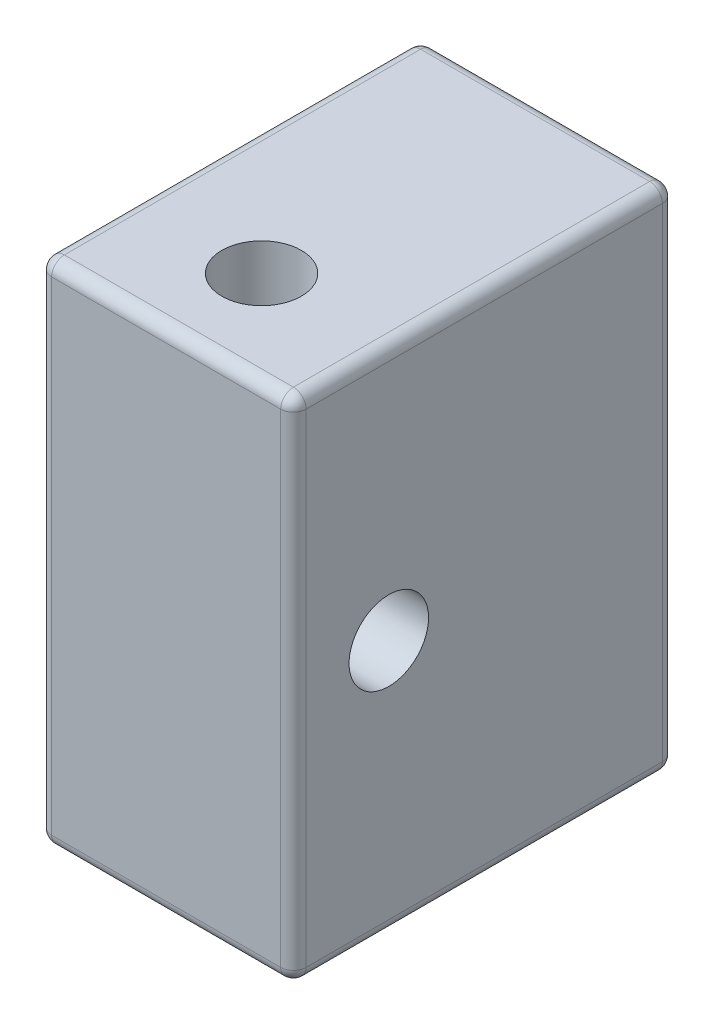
ISO-10303-21;
HEADER;
FILE_DESCRIPTION(('STEP AP214'),'2;1');
FILE_NAME('part.step','',(''),(''),'','','');
FILE_SCHEMA(('AUTOMOTIVE_DESIGN { 1 0 10303 214 1 1 1 1 }'));
ENDSEC;
DATA;
#1=APPLICATION_CONTEXT('core data for automotive mechanical design processes');
#2=APPLICATION_PROTOCOL_DEFINITION('international standard','automotive_design',2000,#1);
#3=PRODUCT_CONTEXT('',#1,'mechanical');
#4=PRODUCT('Part','Part','',(#3));
#5=PRODUCT_RELATED_PRODUCT_CATEGORY('part','',(#4));
#6=PRODUCT_DEFINITION_FORMATION('','',#4);
#7=PRODUCT_DEFINITION_CONTEXT('part definition',#1,'design');
#8=PRODUCT_DEFINITION('design','',#6,#7);
#9=PRODUCT_DEFINITION_SHAPE('','',#8);
#10=(LENGTH_UNIT() NAMED_UNIT(*) SI_UNIT(.MILLI.,.METRE.));
#11=(NAMED_UNIT(*) PLANE_ANGLE_UNIT() SI_UNIT($,.RADIAN.));
#12=(NAMED_UNIT(*) SI_UNIT($,.STERADIAN.) SOLID_ANGLE_UNIT());
#13=UNCERTAINTY_MEASURE_WITH_UNIT(LENGTH_MEASURE(1.E-05),#10,'distance_accuracy_value','');
#14=(GEOMETRIC_REPRESENTATION_CONTEXT(3) GLOBAL_UNCERTAINTY_ASSIGNED_CONTEXT((#13)) GLOBAL_UNIT_ASSIGNED_CONTEXT((#10,
#11,#12)) REPRESENTATION_CONTEXT('',''));
#15=CARTESIAN_POINT('',(0.,0.,0.));
#16=DIRECTION('',(0.,0.,1.));
#17=DIRECTION('',(1.,0.,0.));
#18=AXIS2_PLACEMENT_3D('',#15,#16,#17);
#19=CARTESIAN_POINT('',(50.8,50.8,38.1));
#20=DIRECTION('',(0.,-1.,0.));
#21=DIRECTION('',(0.,0.,-1.));
#22=AXIS2_PLACEMENT_3D('',#19,#20,#21);
#23=PLANE('',#22);
#24=DIRECTION('',(0.,0.,1.));
#25=VECTOR('',#24,1.);
#26=CARTESIAN_POINT('',(48.26,50.8,-38.1));
#27=LINE('',#26,#25);
#28=CARTESIAN_POINT('',(48.26,50.8,35.56));
#29=VERTEX_POINT('',#28);
#30=CARTESIAN_POINT('',(48.26,50.8,-35.56));
#31=VERTEX_POINT('',#30);
#32=EDGE_CURVE('E39',#29,#31,#27,.F.);
#33=ORIENTED_EDGE('',*,*,#32,.T.);
#34=DIRECTION('',(-1.,0.,0.));
#35=VECTOR('',#34,1.);
#36=CARTESIAN_POINT('',(50.8,50.8,-35.56));
#37=LINE('',#36,#35);
#38=CARTESIAN_POINT('',(2.54,50.8,-35.56));
#39=VERTEX_POINT('',#38);
#40=EDGE_CURVE('E11',#31,#39,#37,.T.);
#41=ORIENTED_EDGE('',*,*,#40,.T.);
#42=DIRECTION('',(0.,0.,1.));
#43=VECTOR('',#42,1.);
#44=CARTESIAN_POINT('',(2.54,50.8,38.1));
#45=LINE('',#44,#43);
#46=CARTESIAN_POINT('',(2.54,50.8,35.56));
#47=VERTEX_POINT('',#46);
#48=EDGE_CURVE('E194',#39,#47,#45,.T.);
#49=ORIENTED_EDGE('',*,*,#48,.T.);
#50=DIRECTION('',(-1.,0.,0.));
#51=VECTOR('',#50,1.);
#52=CARTESIAN_POINT('',(50.8,50.8,35.56));
#53=LINE('',#52,#51);
#54=EDGE_CURVE('E50',#47,#29,#53,.F.);
#55=ORIENTED_EDGE('',*,*,#54,.T.);
#56=EDGE_LOOP('',(#33,#41,#49,#55));
#57=FACE_BOUND('',#56,.T.);
#58=CARTESIAN_POINT('',(25.4,50.8,19.05));
#59=DIRECTION('',(0.,-1.,0.));
#60=DIRECTION('',(0.,0.,-1.));
#61=AXIS2_PLACEMENT_3D('',#58,#59,#60);
#62=CIRCLE('',#61,7.9375);
#63=CARTESIAN_POINT('',(25.4,50.8,11.1125));
#64=VERTEX_POINT('',#63);
#65=EDGE_CURVE('E266',#64,#64,#62,.T.);
#66=ORIENTED_EDGE('',*,*,#65,.T.);
#67=EDGE_LOOP('',(#66));
#68=FACE_BOUND('',#67,.T.);
#69=ADVANCED_FACE('F30',(#57,#68),#23,.F.);
#70=CARTESIAN_POINT('',(50.8,50.8,38.1));
#71=DIRECTION('',(0.,0.,-1.));
#72=DIRECTION('',(0.,1.,0.));
#73=AXIS2_PLACEMENT_3D('',#70,#71,#72);
#74=PLANE('',#73);
#75=DIRECTION('',(0.,-1.,0.));
#76=VECTOR('',#75,1.);
#77=CARTESIAN_POINT('',(2.54,50.8,38.1));
#78=LINE('',#77,#76);
#79=CARTESIAN_POINT('',(2.54,48.26,38.1));
#80=VERTEX_POINT('',#79);
#81=CARTESIAN_POINT('',(2.54,-48.26,38.1));
#82=VERTEX_POINT('',#81);
#83=EDGE_CURVE('E178',#80,#82,#78,.T.);
#84=ORIENTED_EDGE('',*,*,#83,.T.);
#85=DIRECTION('',(-1.,0.,0.));
#86=VECTOR('',#85,1.);
#87=CARTESIAN_POINT('',(50.8,-48.26,38.1));
#88=LINE('',#87,#86);
#89=CARTESIAN_POINT('',(48.26,-48.26,38.1));
#90=VERTEX_POINT('',#89);
#91=EDGE_CURVE('E183',#82,#90,#88,.F.);
#92=ORIENTED_EDGE('',*,*,#91,.T.);
#93=DIRECTION('',(0.,-1.,0.));
#94=VECTOR('',#93,1.);
#95=CARTESIAN_POINT('',(48.26,50.8,38.1));
#96=LINE('',#95,#94);
#97=CARTESIAN_POINT('',(48.26,48.26,38.1));
#98=VERTEX_POINT('',#97);
#99=EDGE_CURVE('E180',#90,#98,#96,.F.);
#100=ORIENTED_EDGE('',*,*,#99,.T.);
#101=DIRECTION('',(-1.,0.,0.));
#102=VECTOR('',#101,1.);
#103=CARTESIAN_POINT('',(50.8,48.26,38.1));
#104=LINE('',#103,#102);
#105=EDGE_CURVE('E176',#98,#80,#104,.T.);
#106=ORIENTED_EDGE('',*,*,#105,.T.);
#107=EDGE_LOOP('',(#84,#92,#100,#106));
#108=FACE_BOUND('',#107,.T.);
#109=ADVANCED_FACE('F291',(#108),#74,.F.);
#110=CARTESIAN_POINT('',(50.8,-50.8,38.1));
#111=DIRECTION('',(0.,1.,0.));
#112=DIRECTION('',(0.,0.,1.));
#113=AXIS2_PLACEMENT_3D('',#110,#111,#112);
#114=PLANE('',#113);
#115=CARTESIAN_POINT('',(25.4,-50.8,19.05));
#116=DIRECTION('',(0.,-1.,0.));
#117=DIRECTION('',(0.,0.,-1.));
#118=AXIS2_PLACEMENT_3D('',#115,#116,#117);
#119=CIRCLE('',#118,7.9375);
#120=CARTESIAN_POINT('',(25.4,-50.8,11.1125));
#121=VERTEX_POINT('',#120);
#122=EDGE_CURVE('E272',#121,#121,#119,.T.);
#123=ORIENTED_EDGE('',*,*,#122,.F.);
#124=EDGE_LOOP('',(#123));
#125=FACE_BOUND('',#124,.T.);
#126=DIRECTION('',(0.,0.,-1.));
#127=VECTOR('',#126,1.);
#128=CARTESIAN_POINT('',(48.26,-50.8,38.1));
#129=LINE('',#128,#127);
#130=CARTESIAN_POINT('',(48.26,-50.8,-35.56));
#131=VERTEX_POINT('',#130);
#132=CARTESIAN_POINT('',(48.26,-50.8,35.56));
#133=VERTEX_POINT('',#132);
#134=EDGE_CURVE('E189',#131,#133,#129,.F.);
#135=ORIENTED_EDGE('',*,*,#134,.T.);
#136=DIRECTION('',(-1.,0.,0.));
#137=VECTOR('',#136,1.);
#138=CARTESIAN_POINT('',(50.8,-50.8,35.56));
#139=LINE('',#138,#137);
#140=CARTESIAN_POINT('',(2.54,-50.8,35.56));
#141=VERTEX_POINT('',#140);
#142=EDGE_CURVE('E191',#133,#141,#139,.T.);
#143=ORIENTED_EDGE('',*,*,#142,.T.);
#144=DIRECTION('',(0.,0.,-1.));
#145=VECTOR('',#144,1.);
#146=CARTESIAN_POINT('',(2.54,-50.8,38.1));
#147=LINE('',#146,#145);
#148=CARTESIAN_POINT('',(2.54,-50.8,-35.56));
#149=VERTEX_POINT('',#148);
#150=EDGE_CURVE('E185',#141,#149,#147,.T.);
#151=ORIENTED_EDGE('',*,*,#150,.T.);
#152=DIRECTION('',(-1.,0.,0.));
#153=VECTOR('',#152,1.);
#154=CARTESIAN_POINT('',(50.8,-50.8,-35.56));
#155=LINE('',#154,#153);
#156=EDGE_CURVE('E187',#149,#131,#155,.F.);
#157=ORIENTED_EDGE('',*,*,#156,.T.);
#158=EDGE_LOOP('',(#135,#143,#151,#157));
#159=FACE_BOUND('',#158,.T.);
#160=ADVANCED_FACE('F287',(#125,#159),#114,.F.);
#161=CARTESIAN_POINT('',(50.8,50.8,-38.1));
#162=DIRECTION('',(0.,0.,1.));
#163=DIRECTION('',(0.,-1.,0.));
#164=AXIS2_PLACEMENT_3D('',#161,#162,#163);
#165=PLANE('',#164);
#166=DIRECTION('',(0.,1.,0.));
#167=VECTOR('',#166,1.);
#168=CARTESIAN_POINT('',(48.26,-50.8,-38.1));
#169=LINE('',#168,#167);
#170=CARTESIAN_POINT('',(48.26,48.26,-38.1));
#171=VERTEX_POINT('',#170);
#172=CARTESIAN_POINT('',(48.26,-48.26,-38.1));
#173=VERTEX_POINT('',#172);
#174=EDGE_CURVE('E126',#171,#173,#169,.F.);
#175=ORIENTED_EDGE('',*,*,#174,.T.);
#176=DIRECTION('',(-1.,0.,0.));
#177=VECTOR('',#176,1.);
#178=CARTESIAN_POINT('',(50.8,-48.26,-38.1));
#179=LINE('',#178,#177);
#180=CARTESIAN_POINT('',(2.54,-48.26,-38.1));
#181=VERTEX_POINT('',#180);
#182=EDGE_CURVE('E165',#173,#181,#179,.T.);
#183=ORIENTED_EDGE('',*,*,#182,.T.);
#184=DIRECTION('',(0.,1.,0.));
#185=VECTOR('',#184,1.);
#186=CARTESIAN_POINT('',(2.54,50.8,-38.1));
#187=LINE('',#186,#185);
#188=CARTESIAN_POINT('',(2.54,48.26,-38.1));
#189=VERTEX_POINT('',#188);
#190=EDGE_CURVE('E162',#181,#189,#187,.T.);
#191=ORIENTED_EDGE('',*,*,#190,.T.);
#192=DIRECTION('',(-1.,0.,0.));
#193=VECTOR('',#192,1.);
#194=CARTESIAN_POINT('',(50.8,48.26,-38.1));
#195=LINE('',#194,#193);
#196=EDGE_CURVE('E157',#189,#171,#195,.F.);
#197=ORIENTED_EDGE('',*,*,#196,.T.);
#198=EDGE_LOOP('',(#175,#183,#191,#197));
#199=FACE_BOUND('',#198,.T.);
#200=ADVANCED_FACE('F290',(#199),#165,.F.);
#201=CARTESIAN_POINT('',(50.8,50.8,38.1));
#202=DIRECTION('',(1.,0.,0.));
#203=DIRECTION('',(0.,0.,-1.));
#204=AXIS2_PLACEMENT_3D('',#201,#202,#203);
#205=PLANE('',#204);
#206=DIRECTION('',(0.,-1.,0.));
#207=VECTOR('',#206,1.);
#208=CARTESIAN_POINT('',(50.8,-50.8,35.56));
#209=LINE('',#208,#207);
#210=CARTESIAN_POINT('',(50.8,48.26,35.56));
#211=VERTEX_POINT('',#210);
#212=CARTESIAN_POINT('',(50.8,-48.26,35.56));
#213=VERTEX_POINT('',#212);
#214=EDGE_CURVE('E148',#211,#213,#209,.T.);
#215=ORIENTED_EDGE('',*,*,#214,.T.);
#216=DIRECTION('',(0.,0.,-1.));
#217=VECTOR('',#216,1.);
#218=CARTESIAN_POINT('',(50.8,-48.26,-38.1));
#219=LINE('',#218,#217);
#220=CARTESIAN_POINT('',(50.8,-48.26,-35.56));
#221=VERTEX_POINT('',#220);
#222=EDGE_CURVE('E154',#213,#221,#219,.T.);
#223=ORIENTED_EDGE('',*,*,#222,.T.);
#224=DIRECTION('',(0.,1.,0.));
#225=VECTOR('',#224,1.);
#226=CARTESIAN_POINT('',(50.8,50.8,-35.56));
#227=LINE('',#226,#225);
#228=CARTESIAN_POINT('',(50.8,48.26,-35.56));
#229=VERTEX_POINT('',#228);
#230=EDGE_CURVE('E124',#221,#229,#227,.T.);
#231=ORIENTED_EDGE('',*,*,#230,.T.);
#232=DIRECTION('',(0.,0.,1.));
#233=VECTOR('',#232,1.);
#234=CARTESIAN_POINT('',(50.8,48.26,38.1));
#235=LINE('',#234,#233);
#236=EDGE_CURVE('E142',#229,#211,#235,.T.);
#237=ORIENTED_EDGE('',*,*,#236,.T.);
#238=EDGE_LOOP('',(#215,#223,#231,#237));
#239=FACE_BOUND('',#238,.T.);
#240=CARTESIAN_POINT('',(50.8,0.,19.05));
#241=DIRECTION('',(1.,0.,0.));
#242=DIRECTION('',(0.,0.,-1.));
#243=AXIS2_PLACEMENT_3D('',#240,#241,#242);
#244=CIRCLE('',#243,7.9375);
#245=CARTESIAN_POINT('',(50.8,0.,11.1125));
#246=VERTEX_POINT('',#245);
#247=EDGE_CURVE('E254',#246,#246,#244,.T.);
#248=ORIENTED_EDGE('',*,*,#247,.F.);
#249=EDGE_LOOP('',(#248));
#250=FACE_BOUND('',#249,.T.);
#251=ADVANCED_FACE('F151',(#239,#250),#205,.T.);
#252=CARTESIAN_POINT('',(0.,50.8,38.1));
#253=DIRECTION('',(1.,0.,0.));
#254=DIRECTION('',(0.,0.,-1.));
#255=AXIS2_PLACEMENT_3D('',#252,#253,#254);
#256=PLANE('',#255);
#257=DIRECTION('',(0.,1.,0.));
#258=VECTOR('',#257,1.);
#259=CARTESIAN_POINT('',(0.,50.8,-35.56));
#260=LINE('',#259,#258);
#261=CARTESIAN_POINT('',(0.,48.26,-35.56));
#262=VERTEX_POINT('',#261);
#263=CARTESIAN_POINT('',(0.,-48.26,-35.56));
#264=VERTEX_POINT('',#263);
#265=EDGE_CURVE('E171',#262,#264,#260,.F.);
#266=ORIENTED_EDGE('',*,*,#265,.T.);
#267=DIRECTION('',(0.,0.,-1.));
#268=VECTOR('',#267,1.);
#269=CARTESIAN_POINT('',(0.,-48.26,38.1));
#270=LINE('',#269,#268);
#271=CARTESIAN_POINT('',(0.,-48.26,35.56));
#272=VERTEX_POINT('',#271);
#273=EDGE_CURVE('E174',#264,#272,#270,.F.);
#274=ORIENTED_EDGE('',*,*,#273,.T.);
#275=DIRECTION('',(0.,-1.,0.));
#276=VECTOR('',#275,1.);
#277=CARTESIAN_POINT('',(0.,50.8,35.56));
#278=LINE('',#277,#276);
#279=CARTESIAN_POINT('',(0.,48.26,35.56));
#280=VERTEX_POINT('',#279);
#281=EDGE_CURVE('E169',#272,#280,#278,.F.);
#282=ORIENTED_EDGE('',*,*,#281,.T.);
#283=DIRECTION('',(0.,0.,1.));
#284=VECTOR('',#283,1.);
#285=CARTESIAN_POINT('',(0.,48.26,38.1));
#286=LINE('',#285,#284);
#287=EDGE_CURVE('E167',#280,#262,#286,.F.);
#288=ORIENTED_EDGE('',*,*,#287,.T.);
#289=EDGE_LOOP('',(#266,#274,#282,#288));
#290=FACE_BOUND('',#289,.T.);
#291=ADVANCED_FACE('F370',(#290),#256,.F.);
#292=CARTESIAN_POINT('',(25.4,0.,19.05));
#293=DIRECTION('',(1.,0.,0.));
#294=DIRECTION('',(0.,0.,-1.));
#295=AXIS2_PLACEMENT_3D('',#292,#293,#294);
#296=CYLINDRICAL_SURFACE('',#295,7.9375);
#297=CARTESIAN_POINT('',(25.4,0.,19.05));
#298=DIRECTION('',(1.,0.,0.));
#299=DIRECTION('',(0.,0.,-1.));
#300=AXIS2_PLACEMENT_3D('',#297,#298,#299);
#301=CIRCLE('',#300,7.9375);
#302=CARTESIAN_POINT('',(25.4,0.,11.1125));
#303=VERTEX_POINT('',#302);
#304=EDGE_CURVE('E149',#303,#303,#301,.T.);
#305=ORIENTED_EDGE('',*,*,#304,.F.);
#306=EDGE_LOOP('',(#305));
#307=FACE_BOUND('',#306,.T.);
#308=ORIENTED_EDGE('',*,*,#247,.T.);
#309=EDGE_LOOP('',(#308));
#310=FACE_BOUND('',#309,.T.);
#311=ADVANCED_FACE('F557',(#307,#310),#296,.F.);
#312=CARTESIAN_POINT('',(25.4,0.,19.05));
#313=DIRECTION('',(1.,0.,0.));
#314=DIRECTION('',(0.,0.,-1.));
#315=AXIS2_PLACEMENT_3D('',#312,#313,#314);
#316=PLANE('',#315);
#317=ORIENTED_EDGE('',*,*,#304,.T.);
#318=EDGE_LOOP('',(#317));
#319=FACE_BOUND('',#318,.T.);
#320=ADVANCED_FACE('F549',(#319),#316,.T.);
#321=CARTESIAN_POINT('',(2.54,50.8,35.56));
#322=DIRECTION('',(0.,-1.,0.));
#323=DIRECTION('',(0.,0.,-1.));
#324=AXIS2_PLACEMENT_3D('',#321,#322,#323);
#325=CYLINDRICAL_SURFACE('',#324,2.54);
#326=CARTESIAN_POINT('',(2.54,-48.26,35.56));
#327=DIRECTION('',(0.,-1.,0.));
#328=DIRECTION('',(0.,0.,-1.));
#329=AXIS2_PLACEMENT_3D('',#326,#327,#328);
#330=CIRCLE('',#329,2.54);
#331=EDGE_CURVE('E34',#82,#272,#330,.T.);
#332=ORIENTED_EDGE('',*,*,#331,.F.);
#333=ORIENTED_EDGE('',*,*,#83,.F.);
#334=CARTESIAN_POINT('',(2.54,48.26,35.56));
#335=DIRECTION('',(0.,1.,0.));
#336=DIRECTION('',(0.,0.,1.));
#337=AXIS2_PLACEMENT_3D('',#334,#335,#336);
#338=CIRCLE('',#337,2.54);
#339=EDGE_CURVE('E247',#280,#80,#338,.T.);
#340=ORIENTED_EDGE('',*,*,#339,.F.);
#341=ORIENTED_EDGE('',*,*,#281,.F.);
#342=EDGE_LOOP('',(#332,#333,#340,#341));
#343=FACE_BOUND('',#342,.T.);
#344=ADVANCED_FACE('F32',(#343),#325,.T.);
#345=CARTESIAN_POINT('',(2.54,-48.26,35.56));
#346=DIRECTION('',(0.,0.,1.));
#347=DIRECTION('',(1.,0.,0.));
#348=AXIS2_PLACEMENT_3D('',#345,#346,#347);
#349=SPHERICAL_SURFACE('',#348,2.54);
#350=CARTESIAN_POINT('',(2.54,-48.26,35.56));
#351=DIRECTION('',(-1.,0.,0.));
#352=DIRECTION('',(0.,0.,1.));
#353=AXIS2_PLACEMENT_3D('',#350,#351,#352);
#354=CIRCLE('',#353,2.54);
#355=EDGE_CURVE('E242',#82,#141,#354,.F.);
#356=ORIENTED_EDGE('',*,*,#355,.F.);
#357=ORIENTED_EDGE('',*,*,#331,.T.);
#358=CARTESIAN_POINT('',(2.54,-48.26,35.56));
#359=DIRECTION('',(0.,0.,1.));
#360=DIRECTION('',(1.,0.,0.));
#361=AXIS2_PLACEMENT_3D('',#358,#359,#360);
#362=CIRCLE('',#361,2.54);
#363=EDGE_CURVE('E245',#141,#272,#362,.F.);
#364=ORIENTED_EDGE('',*,*,#363,.F.);
#365=EDGE_LOOP('',(#356,#357,#364));
#366=FACE_BOUND('',#365,.T.);
#367=ADVANCED_FACE('F341',(#366),#349,.T.);
#368=CARTESIAN_POINT('',(2.54,48.26,35.56));
#369=DIRECTION('',(0.,0.,1.));
#370=DIRECTION('',(1.,0.,0.));
#371=AXIS2_PLACEMENT_3D('',#368,#369,#370);
#372=SPHERICAL_SURFACE('',#371,2.54);
#373=CARTESIAN_POINT('',(2.54,48.26,35.56));
#374=DIRECTION('',(0.,0.,1.));
#375=DIRECTION('',(1.,0.,0.));
#376=AXIS2_PLACEMENT_3D('',#373,#374,#375);
#377=CIRCLE('',#376,2.54);
#378=EDGE_CURVE('E236',#280,#47,#377,.F.);
#379=ORIENTED_EDGE('',*,*,#378,.F.);
#380=ORIENTED_EDGE('',*,*,#339,.T.);
#381=CARTESIAN_POINT('',(2.54,48.26,35.56));
#382=DIRECTION('',(-1.,0.,0.));
#383=DIRECTION('',(0.,0.,1.));
#384=AXIS2_PLACEMENT_3D('',#381,#382,#383);
#385=CIRCLE('',#384,2.54);
#386=EDGE_CURVE('E239',#47,#80,#385,.F.);
#387=ORIENTED_EDGE('',*,*,#386,.F.);
#388=EDGE_LOOP('',(#379,#380,#387));
#389=FACE_BOUND('',#388,.T.);
#390=ADVANCED_FACE('F327',(#389),#372,.T.);
#391=CARTESIAN_POINT('',(2.54,-48.26,38.1));
#392=DIRECTION('',(0.,0.,-1.));
#393=DIRECTION('',(-1.,0.,0.));
#394=AXIS2_PLACEMENT_3D('',#391,#392,#393);
#395=CYLINDRICAL_SURFACE('',#394,2.54);
#396=ORIENTED_EDGE('',*,*,#363,.T.);
#397=ORIENTED_EDGE('',*,*,#273,.F.);
#398=CARTESIAN_POINT('',(2.54,-48.26,-35.56));
#399=DIRECTION('',(0.,0.,-1.));
#400=DIRECTION('',(-1.,0.,0.));
#401=AXIS2_PLACEMENT_3D('',#398,#399,#400);
#402=CIRCLE('',#401,2.54);
#403=EDGE_CURVE('E231',#149,#264,#402,.T.);
#404=ORIENTED_EDGE('',*,*,#403,.F.);
#405=ORIENTED_EDGE('',*,*,#150,.F.);
#406=EDGE_LOOP('',(#396,#397,#404,#405));
#407=FACE_BOUND('',#406,.T.);
#408=ADVANCED_FACE('F344',(#407),#395,.T.);
#409=CARTESIAN_POINT('',(50.8,-48.26,35.56));
#410=DIRECTION('',(-1.,0.,0.));
#411=DIRECTION('',(0.,0.,1.));
#412=AXIS2_PLACEMENT_3D('',#409,#410,#411);
#413=CYLINDRICAL_SURFACE('',#412,2.54);
#414=ORIENTED_EDGE('',*,*,#355,.T.);
#415=ORIENTED_EDGE('',*,*,#142,.F.);
#416=CARTESIAN_POINT('',(48.26,-48.26,35.56));
#417=DIRECTION('',(1.,0.,0.));
#418=DIRECTION('',(0.,0.,-1.));
#419=AXIS2_PLACEMENT_3D('',#416,#417,#418);
#420=CIRCLE('',#419,2.54);
#421=EDGE_CURVE('E228',#90,#133,#420,.T.);
#422=ORIENTED_EDGE('',*,*,#421,.F.);
#423=ORIENTED_EDGE('',*,*,#91,.F.);
#424=EDGE_LOOP('',(#414,#415,#422,#423));
#425=FACE_BOUND('',#424,.T.);
#426=ADVANCED_FACE('F300',(#425),#413,.T.);
#427=CARTESIAN_POINT('',(48.26,50.8,35.56));
#428=DIRECTION('',(0.,1.,0.));
#429=DIRECTION('',(0.,0.,1.));
#430=AXIS2_PLACEMENT_3D('',#427,#428,#429);
#431=CYLINDRICAL_SURFACE('',#430,2.54);
#432=CARTESIAN_POINT('',(48.26,48.26,35.56));
#433=DIRECTION('',(0.,1.,0.));
#434=DIRECTION('',(0.,0.,1.));
#435=AXIS2_PLACEMENT_3D('',#432,#433,#434);
#436=CIRCLE('',#435,2.54);
#437=EDGE_CURVE('E222',#98,#211,#436,.T.);
#438=ORIENTED_EDGE('',*,*,#437,.F.);
#439=ORIENTED_EDGE('',*,*,#99,.F.);
#440=CARTESIAN_POINT('',(48.26,-48.26,35.56));
#441=DIRECTION('',(0.,-1.,0.));
#442=DIRECTION('',(0.,0.,-1.));
#443=AXIS2_PLACEMENT_3D('',#440,#441,#442);
#444=CIRCLE('',#443,2.54);
#445=EDGE_CURVE('E225',#213,#90,#444,.T.);
#446=ORIENTED_EDGE('',*,*,#445,.F.);
#447=ORIENTED_EDGE('',*,*,#214,.F.);
#448=EDGE_LOOP('',(#438,#439,#446,#447));
#449=FACE_BOUND('',#448,.T.);
#450=ADVANCED_FACE('F336',(#449),#431,.T.);
#451=CARTESIAN_POINT('',(50.8,48.26,35.56));
#452=DIRECTION('',(-1.,0.,0.));
#453=DIRECTION('',(0.,0.,1.));
#454=AXIS2_PLACEMENT_3D('',#451,#452,#453);
#455=CYLINDRICAL_SURFACE('',#454,2.54);
#456=ORIENTED_EDGE('',*,*,#386,.T.);
#457=ORIENTED_EDGE('',*,*,#105,.F.);
#458=CARTESIAN_POINT('',(48.26,48.26,35.56));
#459=DIRECTION('',(1.,0.,0.));
#460=DIRECTION('',(0.,0.,-1.));
#461=AXIS2_PLACEMENT_3D('',#458,#459,#460);
#462=CIRCLE('',#461,2.54);
#463=EDGE_CURVE('E220',#29,#98,#462,.T.);
#464=ORIENTED_EDGE('',*,*,#463,.F.);
#465=ORIENTED_EDGE('',*,*,#54,.F.);
#466=EDGE_LOOP('',(#456,#457,#464,#465));
#467=FACE_BOUND('',#466,.T.);
#468=ADVANCED_FACE('F330',(#467),#455,.T.);
#469=CARTESIAN_POINT('',(2.54,48.26,38.1));
#470=DIRECTION('',(0.,0.,1.));
#471=DIRECTION('',(0.,-1.,0.));
#472=AXIS2_PLACEMENT_3D('',#469,#470,#471);
#473=CYLINDRICAL_SURFACE('',#472,2.54);
#474=ORIENTED_EDGE('',*,*,#378,.T.);
#475=ORIENTED_EDGE('',*,*,#48,.F.);
#476=CARTESIAN_POINT('',(2.54,48.26,-35.56));
#477=DIRECTION('',(0.,0.,-1.));
#478=DIRECTION('',(-1.,0.,0.));
#479=AXIS2_PLACEMENT_3D('',#476,#477,#478);
#480=CIRCLE('',#479,2.54);
#481=EDGE_CURVE('E217',#262,#39,#480,.T.);
#482=ORIENTED_EDGE('',*,*,#481,.F.);
#483=ORIENTED_EDGE('',*,*,#287,.F.);
#484=EDGE_LOOP('',(#474,#475,#482,#483));
#485=FACE_BOUND('',#484,.T.);
#486=ADVANCED_FACE('F326',(#485),#473,.T.);
#487=CARTESIAN_POINT('',(2.54,50.8,-35.56));
#488=DIRECTION('',(0.,1.,0.));
#489=DIRECTION('',(0.,0.,1.));
#490=AXIS2_PLACEMENT_3D('',#487,#488,#489);
#491=CYLINDRICAL_SURFACE('',#490,2.54);
#492=CARTESIAN_POINT('',(2.54,-48.26,-35.56));
#493=DIRECTION('',(0.,-1.,0.));
#494=DIRECTION('',(0.,0.,-1.));
#495=AXIS2_PLACEMENT_3D('',#492,#493,#494);
#496=CIRCLE('',#495,2.54);
#497=EDGE_CURVE('E233',#264,#181,#496,.T.);
#498=ORIENTED_EDGE('',*,*,#497,.F.);
#499=ORIENTED_EDGE('',*,*,#265,.F.);
#500=CARTESIAN_POINT('',(2.54,48.26,-35.56));
#501=DIRECTION('',(0.,1.,0.));
#502=DIRECTION('',(0.,0.,1.));
#503=AXIS2_PLACEMENT_3D('',#500,#501,#502);
#504=CIRCLE('',#503,2.54);
#505=EDGE_CURVE('E214',#189,#262,#504,.T.);
#506=ORIENTED_EDGE('',*,*,#505,.F.);
#507=ORIENTED_EDGE('',*,*,#190,.F.);
#508=EDGE_LOOP('',(#498,#499,#506,#507));
#509=FACE_BOUND('',#508,.T.);
#510=ADVANCED_FACE('F351',(#509),#491,.T.);
#511=CARTESIAN_POINT('',(2.54,-48.26,-35.56));
#512=DIRECTION('',(0.,0.,1.));
#513=DIRECTION('',(1.,0.,0.));
#514=AXIS2_PLACEMENT_3D('',#511,#512,#513);
#515=SPHERICAL_SURFACE('',#514,2.54);
#516=ORIENTED_EDGE('',*,*,#403,.T.);
#517=ORIENTED_EDGE('',*,*,#497,.T.);
#518=CARTESIAN_POINT('',(2.54,-48.26,-35.56));
#519=DIRECTION('',(-1.,0.,0.));
#520=DIRECTION('',(0.,0.,1.));
#521=AXIS2_PLACEMENT_3D('',#518,#519,#520);
#522=CIRCLE('',#521,2.54);
#523=EDGE_CURVE('E211',#149,#181,#522,.F.);
#524=ORIENTED_EDGE('',*,*,#523,.F.);
#525=EDGE_LOOP('',(#516,#517,#524));
#526=FACE_BOUND('',#525,.T.);
#527=ADVANCED_FACE('F348',(#526),#515,.T.);
#528=CARTESIAN_POINT('',(48.26,-48.26,35.56));
#529=DIRECTION('',(0.,0.,1.));
#530=DIRECTION('',(1.,0.,0.));
#531=AXIS2_PLACEMENT_3D('',#528,#529,#530);
#532=SPHERICAL_SURFACE('',#531,2.54);
#533=ORIENTED_EDGE('',*,*,#445,.T.);
#534=ORIENTED_EDGE('',*,*,#421,.T.);
#535=CARTESIAN_POINT('',(48.26,-48.26,35.56));
#536=DIRECTION('',(0.,0.,1.));
#537=DIRECTION('',(1.,0.,0.));
#538=AXIS2_PLACEMENT_3D('',#535,#536,#537);
#539=CIRCLE('',#538,2.54);
#540=EDGE_CURVE('E208',#213,#133,#539,.F.);
#541=ORIENTED_EDGE('',*,*,#540,.F.);
#542=EDGE_LOOP('',(#533,#534,#541));
#543=FACE_BOUND('',#542,.T.);
#544=ADVANCED_FACE('F304',(#543),#532,.T.);
#545=CARTESIAN_POINT('',(48.26,48.26,35.56));
#546=DIRECTION('',(0.,0.,1.));
#547=DIRECTION('',(1.,0.,0.));
#548=AXIS2_PLACEMENT_3D('',#545,#546,#547);
#549=SPHERICAL_SURFACE('',#548,2.54);
#550=ORIENTED_EDGE('',*,*,#463,.T.);
#551=ORIENTED_EDGE('',*,*,#437,.T.);
#552=CARTESIAN_POINT('',(48.26,48.26,35.56));
#553=DIRECTION('',(0.,0.,1.));
#554=DIRECTION('',(1.,0.,0.));
#555=AXIS2_PLACEMENT_3D('',#552,#553,#554);
#556=CIRCLE('',#555,2.54);
#557=EDGE_CURVE('E145',#29,#211,#556,.F.);
#558=ORIENTED_EDGE('',*,*,#557,.F.);
#559=EDGE_LOOP('',(#550,#551,#558));
#560=FACE_BOUND('',#559,.T.);
#561=ADVANCED_FACE('F333',(#560),#549,.T.);
#562=CARTESIAN_POINT('',(2.54,48.26,-35.56));
#563=DIRECTION('',(0.,0.,1.));
#564=DIRECTION('',(1.,0.,0.));
#565=AXIS2_PLACEMENT_3D('',#562,#563,#564);
#566=SPHERICAL_SURFACE('',#565,2.54);
#567=ORIENTED_EDGE('',*,*,#505,.T.);
#568=ORIENTED_EDGE('',*,*,#481,.T.);
#569=CARTESIAN_POINT('',(2.54,48.26,-35.56));
#570=DIRECTION('',(-1.,0.,0.));
#571=DIRECTION('',(0.,0.,1.));
#572=AXIS2_PLACEMENT_3D('',#569,#570,#571);
#573=CIRCLE('',#572,2.54);
#574=EDGE_CURVE('E205',#189,#39,#573,.F.);
#575=ORIENTED_EDGE('',*,*,#574,.F.);
#576=EDGE_LOOP('',(#567,#568,#575));
#577=FACE_BOUND('',#576,.T.);
#578=ADVANCED_FACE('F353',(#577),#566,.T.);
#579=CARTESIAN_POINT('',(50.8,-48.26,-35.56));
#580=DIRECTION('',(-1.,0.,0.));
#581=DIRECTION('',(0.,0.,1.));
#582=AXIS2_PLACEMENT_3D('',#579,#580,#581);
#583=CYLINDRICAL_SURFACE('',#582,2.54);
#584=ORIENTED_EDGE('',*,*,#523,.T.);
#585=ORIENTED_EDGE('',*,*,#182,.F.);
#586=CARTESIAN_POINT('',(48.26,-48.26,-35.56));
#587=DIRECTION('',(1.,0.,0.));
#588=DIRECTION('',(0.,0.,-1.));
#589=AXIS2_PLACEMENT_3D('',#586,#587,#588);
#590=CIRCLE('',#589,2.54);
#591=EDGE_CURVE('E202',#131,#173,#590,.T.);
#592=ORIENTED_EDGE('',*,*,#591,.F.);
#593=ORIENTED_EDGE('',*,*,#156,.F.);
#594=EDGE_LOOP('',(#584,#585,#592,#593));
#595=FACE_BOUND('',#594,.T.);
#596=ADVANCED_FACE('F312',(#595),#583,.T.);
#597=CARTESIAN_POINT('',(48.26,-48.26,38.1));
#598=DIRECTION('',(0.,0.,1.));
#599=DIRECTION('',(1.,0.,0.));
#600=AXIS2_PLACEMENT_3D('',#597,#598,#599);
#601=CYLINDRICAL_SURFACE('',#600,2.54);
#602=ORIENTED_EDGE('',*,*,#540,.T.);
#603=ORIENTED_EDGE('',*,*,#134,.F.);
#604=CARTESIAN_POINT('',(48.26,-48.26,-35.56));
#605=DIRECTION('',(0.,0.,-1.));
#606=DIRECTION('',(-1.,0.,0.));
#607=AXIS2_PLACEMENT_3D('',#604,#605,#606);
#608=CIRCLE('',#607,2.54);
#609=EDGE_CURVE('E139',#221,#131,#608,.T.);
#610=ORIENTED_EDGE('',*,*,#609,.F.);
#611=ORIENTED_EDGE('',*,*,#222,.F.);
#612=EDGE_LOOP('',(#602,#603,#610,#611));
#613=FACE_BOUND('',#612,.T.);
#614=ADVANCED_FACE('F306',(#613),#601,.T.);
#615=CARTESIAN_POINT('',(48.26,48.26,38.1));
#616=DIRECTION('',(0.,0.,-1.));
#617=DIRECTION('',(0.,1.,0.));
#618=AXIS2_PLACEMENT_3D('',#615,#616,#617);
#619=CYLINDRICAL_SURFACE('',#618,2.54);
#620=ORIENTED_EDGE('',*,*,#557,.T.);
#621=ORIENTED_EDGE('',*,*,#236,.F.);
#622=CARTESIAN_POINT('',(48.26,48.26,-35.56));
#623=DIRECTION('',(0.,0.,-1.));
#624=DIRECTION('',(-1.,0.,0.));
#625=AXIS2_PLACEMENT_3D('',#622,#623,#624);
#626=CIRCLE('',#625,2.54);
#627=EDGE_CURVE('E133',#31,#229,#626,.T.);
#628=ORIENTED_EDGE('',*,*,#627,.F.);
#629=ORIENTED_EDGE('',*,*,#32,.F.);
#630=EDGE_LOOP('',(#620,#621,#628,#629));
#631=FACE_BOUND('',#630,.T.);
#632=ADVANCED_FACE('F143',(#631),#619,.T.);
#633=CARTESIAN_POINT('',(50.8,48.26,-35.56));
#634=DIRECTION('',(-1.,0.,0.));
#635=DIRECTION('',(0.,0.,1.));
#636=AXIS2_PLACEMENT_3D('',#633,#634,#635);
#637=CYLINDRICAL_SURFACE('',#636,2.54);
#638=ORIENTED_EDGE('',*,*,#574,.T.);
#639=ORIENTED_EDGE('',*,*,#40,.F.);
#640=CARTESIAN_POINT('',(48.26,48.26,-35.56));
#641=DIRECTION('',(1.,0.,0.));
#642=DIRECTION('',(0.,0.,-1.));
#643=AXIS2_PLACEMENT_3D('',#640,#641,#642);
#644=CIRCLE('',#643,2.54);
#645=EDGE_CURVE('E137',#171,#31,#644,.T.);
#646=ORIENTED_EDGE('',*,*,#645,.F.);
#647=ORIENTED_EDGE('',*,*,#196,.F.);
#648=EDGE_LOOP('',(#638,#639,#646,#647));
#649=FACE_BOUND('',#648,.T.);
#650=ADVANCED_FACE('F319',(#649),#637,.T.);
#651=CARTESIAN_POINT('',(48.26,-48.26,-35.56));
#652=DIRECTION('',(0.,0.,1.));
#653=DIRECTION('',(1.,0.,0.));
#654=AXIS2_PLACEMENT_3D('',#651,#652,#653);
#655=SPHERICAL_SURFACE('',#654,2.54);
#656=ORIENTED_EDGE('',*,*,#609,.T.);
#657=ORIENTED_EDGE('',*,*,#591,.T.);
#658=CARTESIAN_POINT('',(48.26,-48.26,-35.56));
#659=DIRECTION('',(0.,-1.,0.));
#660=DIRECTION('',(1.,0.,0.));
#661=AXIS2_PLACEMENT_3D('',#658,#659,#660);
#662=CIRCLE('',#661,2.54);
#663=EDGE_CURVE('E129',#221,#173,#662,.F.);
#664=ORIENTED_EDGE('',*,*,#663,.F.);
#665=EDGE_LOOP('',(#656,#657,#664));
#666=FACE_BOUND('',#665,.T.);
#667=ADVANCED_FACE('F309',(#666),#655,.T.);
#668=CARTESIAN_POINT('',(48.26,48.26,-35.56));
#669=DIRECTION('',(0.,0.,1.));
#670=DIRECTION('',(1.,0.,0.));
#671=AXIS2_PLACEMENT_3D('',#668,#669,#670);
#672=SPHERICAL_SURFACE('',#671,2.54);
#673=ORIENTED_EDGE('',*,*,#645,.T.);
#674=ORIENTED_EDGE('',*,*,#627,.T.);
#675=CARTESIAN_POINT('',(48.26,48.26,-35.56));
#676=DIRECTION('',(0.,1.,0.));
#677=DIRECTION('',(0.,0.,1.));
#678=AXIS2_PLACEMENT_3D('',#675,#676,#677);
#679=CIRCLE('',#678,2.54);
#680=EDGE_CURVE('E120',#171,#229,#679,.F.);
#681=ORIENTED_EDGE('',*,*,#680,.F.);
#682=EDGE_LOOP('',(#673,#674,#681));
#683=FACE_BOUND('',#682,.T.);
#684=ADVANCED_FACE('F135',(#683),#672,.T.);
#685=CARTESIAN_POINT('',(48.26,50.8,-35.56));
#686=DIRECTION('',(0.,-1.,0.));
#687=DIRECTION('',(0.,0.,-1.));
#688=AXIS2_PLACEMENT_3D('',#685,#686,#687);
#689=CYLINDRICAL_SURFACE('',#688,2.54);
#690=ORIENTED_EDGE('',*,*,#663,.T.);
#691=ORIENTED_EDGE('',*,*,#174,.F.);
#692=ORIENTED_EDGE('',*,*,#680,.T.);
#693=ORIENTED_EDGE('',*,*,#230,.F.);
#694=EDGE_LOOP('',(#690,#691,#692,#693));
#695=FACE_BOUND('',#694,.T.);
#696=ADVANCED_FACE('F122',(#695),#689,.T.);
#697=CARTESIAN_POINT('',(25.4,38.1,19.05));
#698=DIRECTION('',(0.,1.,0.));
#699=DIRECTION('',(0.,0.,1.));
#700=AXIS2_PLACEMENT_3D('',#697,#698,#699);
#701=CYLINDRICAL_SURFACE('',#700,7.9375);
#702=CARTESIAN_POINT('',(25.4,38.1,19.05));
#703=DIRECTION('',(0.,-1.,0.));
#704=DIRECTION('',(0.,0.,-1.));
#705=AXIS2_PLACEMENT_3D('',#702,#703,#704);
#706=CIRCLE('',#705,7.9375);
#707=CARTESIAN_POINT('',(25.4,38.1,11.1125));
#708=VERTEX_POINT('',#707);
#709=EDGE_CURVE('E130',#708,#708,#706,.T.);
#710=ORIENTED_EDGE('',*,*,#709,.T.);
#711=EDGE_LOOP('',(#710));
#712=FACE_BOUND('',#711,.T.);
#713=ORIENTED_EDGE('',*,*,#65,.F.);
#714=EDGE_LOOP('',(#713));
#715=FACE_BOUND('',#714,.T.);
#716=ADVANCED_FACE('F376',(#712,#715),#701,.F.);
#717=CARTESIAN_POINT('',(25.4,38.1,19.05));
#718=DIRECTION('',(0.,-1.,0.));
#719=DIRECTION('',(0.,0.,-1.));
#720=AXIS2_PLACEMENT_3D('',#717,#718,#719);
#721=PLANE('',#720);
#722=ORIENTED_EDGE('',*,*,#709,.F.);
#723=EDGE_LOOP('',(#722));
#724=FACE_BOUND('',#723,.T.);
#725=ADVANCED_FACE('F283',(#724),#721,.F.);
#726=CARTESIAN_POINT('',(25.4,-38.1,19.05));
#727=DIRECTION('',(0.,-1.,0.));
#728=DIRECTION('',(0.,0.,-1.));
#729=AXIS2_PLACEMENT_3D('',#726,#727,#728);
#730=CYLINDRICAL_SURFACE('',#729,7.9375);
#731=CARTESIAN_POINT('',(25.4,-38.1,19.05));
#732=DIRECTION('',(0.,-1.,0.));
#733=DIRECTION('',(0.,0.,-1.));
#734=AXIS2_PLACEMENT_3D('',#731,#732,#733);
#735=CIRCLE('',#734,7.9375);
#736=CARTESIAN_POINT('',(25.4,-38.1,11.1125));
#737=VERTEX_POINT('',#736);
#738=EDGE_CURVE('E269',#737,#737,#735,.T.);
#739=ORIENTED_EDGE('',*,*,#738,.F.);
#740=EDGE_LOOP('',(#739));
#741=FACE_BOUND('',#740,.T.);
#742=ORIENTED_EDGE('',*,*,#122,.T.);
#743=EDGE_LOOP('',(#742));
#744=FACE_BOUND('',#743,.T.);
#745=ADVANCED_FACE('F280',(#741,#744),#730,.F.);
#746=CARTESIAN_POINT('',(25.4,-38.1,19.05));
#747=DIRECTION('',(0.,-1.,0.));
#748=DIRECTION('',(0.,0.,-1.));
#749=AXIS2_PLACEMENT_3D('',#746,#747,#748);
#750=PLANE('',#749);
#751=ORIENTED_EDGE('',*,*,#738,.T.);
#752=EDGE_LOOP('',(#751));
#753=FACE_BOUND('',#752,.T.);
#754=ADVANCED_FACE('F278',(#753),#750,.T.);
#755=CLOSED_SHELL('',(#69,#109,#160,#200,#251,#291,#311,#320,#344,#367,#390,#408,#426,#450,#468,
#486,#510,#527,#544,#561,#578,#596,#614,#632,#650,#667,#684,#696,#716,#725,#745,#754));
#756=MANIFOLD_SOLID_BREP('B2',#755);
#757=ADVANCED_BREP_SHAPE_REPRESENTATION('',(#18,#756),#14);
#758=SHAPE_DEFINITION_REPRESENTATION(#9,#757);
ENDSEC;
END-ISO-10303-21;
